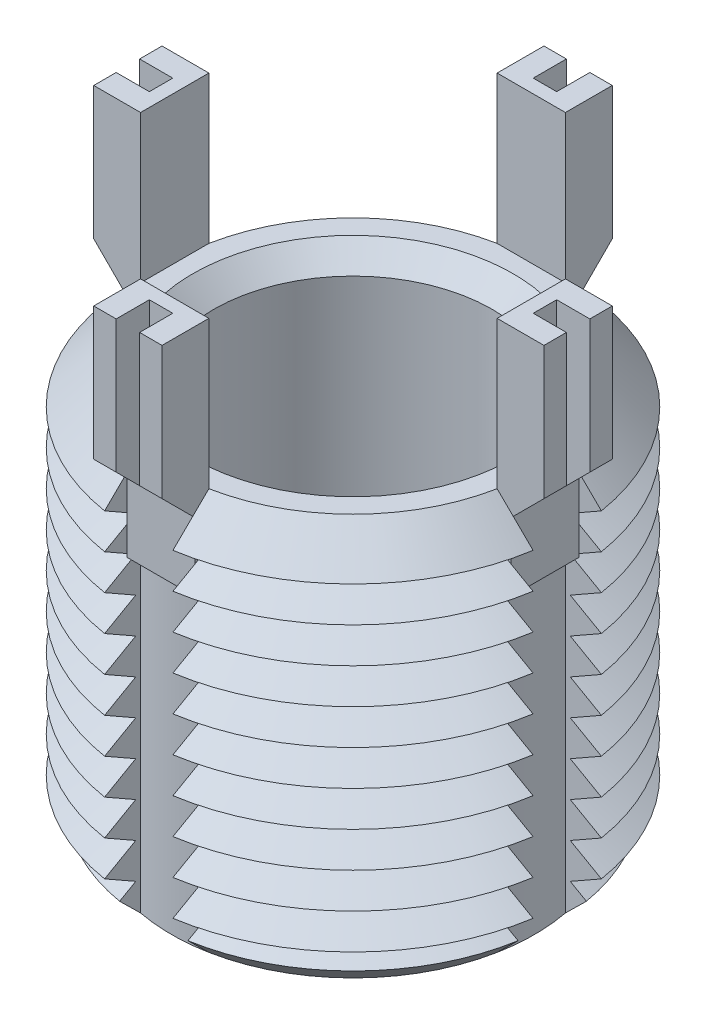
from build123d import *

# Parameters (mm, degrees)
SKETCH1_R               = 11.1125
BOSS_EXTRUDE1_DEPTH     = 20.574
CHAMFER1_SIZE           = 1.814
LPATTERN1_COUNT         = 10
LPATTERN1_PITCH         = 1.814
CUT_EXTRUDE1_REACH      = 27.889
CIRPATTERN1_COUNT       = 4
BOSS_EXTRUDE3_DEPTH     = 1.75
CIRPATTERN2_COUNT       = 4
CUT_EXTRUDE3_DEPTH      = 33.517673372
CUT_EXTRUDE3_DEPTH_BACK = 33.517673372
SKETCH6_W               = 1.7
SKETCH6_H               = 1.2
SKETCH6_W_2             = 1.2
SKETCH6_H_2             = 1.7
SKETCH7_R               = 7.144
CUT_EXTRUDE4_DEPTH      = 20.574
CHAMFER2_SIZE           = 1.0585


with BuildPart() as part:
    # Sketch1 → Boss-Extrude1 (new body)
    with BuildSketch(Plane(origin=(0, 0, 0), x_dir=(1, 0, 0), z_dir=(0, 1, 0))):
        with Locations(Location((0, 0, 0), (0, 0, 270))):
            Circle(SKETCH1_R)
    extrude(amount=-BOSS_EXTRUDE1_DEPTH)

    # Chamfer1
    chamfer1_edges = [part.edges().sort_by_distance(p)[0] for p in [
        (0, 0, -11.1125),
        (0, -20.574, -11.1125),
    ]]
    chamfer(chamfer1_edges, length=CHAMFER1_SIZE)

    # Sketch3 → Cut-Revolve1 (revolve, cut)
    with BuildSketch(Plane(origin=(0, 0, 0), x_dir=(0, 0, -1), z_dir=(1, 0, 0))):
        Polygon((-11.1125, -1.814), (-9.541529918, -2.721), (-11.1125, -3.628), align=None)
    cut_revolve1 = revolve(axis=Axis((0, 0.885892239, 0), (0, -1, 0)), mode=Mode.SUBTRACT)

    # LPattern1: Cut-Revolve1 ×10
    with Locations(*[(0, -i * LPATTERN1_PITCH, 0) for i in range(1, LPATTERN1_COUNT)]):
        add(cut_revolve1, mode=Mode.SUBTRACT)

    # Cut-Extrude1: up to this cone (the profile starts inside it)
    cut_extrude1_end = Plane(origin=(0, 0, 0), z_dir=(0, 1, 0)).offset(-29.872499) * Cone(1e-06, 88.134, 88.133999, align=(Align.CENTER, Align.CENTER, Align.MIN), mode=Mode.PRIVATE)
    # Sketch4 → Cut-Extrude1 (cut, up to the surface)
    with BuildSketch(Plane(origin=(0, 0, 0), x_dir=(1, 0, 0), z_dir=(0, 1, 0)), mode=Mode.PRIVATE) as cut_extrude1_sk1:
        with BuildLine():
            Line((-9.132338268, 1.75), (-10.973839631, 1.75))
            ThreePointArc((-10.973839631, 1.75), (-11.1125, 0), (-10.973839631, -1.75))
            Line((-10.973839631, -1.75), (-9.132338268, -1.75))
            ThreePointArc((-9.132338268, -1.75), (-9.2985, 0), (-9.132338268, 1.75))
        make_face()
    cut_extrude1_tool1 = extrude(cut_extrude1_sk1.sketch, amount=-CUT_EXTRUDE1_REACH, mode=Mode.PRIVATE) & cut_extrude1_end
    cut_extrude1 = cut_extrude1_tool1.solids().sort_by_distance((-10.154651, 0, 0))[0]
    add(cut_extrude1, mode=Mode.SUBTRACT)

    # CirPattern1: Cut-Extrude1 ×4 about axis
    cirpattern1_axis = Axis((0, 0, 0), (0, 1, 0))
    for i in range(1, CIRPATTERN1_COUNT):
        add(cut_extrude1.rotate(cirpattern1_axis, i * 360 / CIRPATTERN1_COUNT), mode=Mode.SUBTRACT)

    # Sketch5 → Boss-Extrude3 (add, symmetric)
    with BuildSketch(Plane(origin=(0, 0, 0), x_dir=(0, 0, -1), z_dir=(1, 0, 0))):
        Polygon((-9.132338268, 7.558), (-9.132338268, -4.442), (-9.832338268, -4.442), (-9.832338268, -0.942), (-11.532338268, 0.758), (-11.532338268, 7.558), align=None)
    boss_extrude3 = extrude(amount=BOSS_EXTRUDE3_DEPTH, both=True)

    # CirPattern2: Boss-Extrude3 ×4 about axis
    cirpattern2_axis = Axis((0, 0, 0), (0, 1, 0))
    for i in range(1, CIRPATTERN2_COUNT):
        add(boss_extrude3.rotate(cirpattern2_axis, i * 360 / CIRPATTERN2_COUNT))

    # Sketch6 → Cut-Extrude3 (cut, two sides: drawn at the far end of the back side and taken through both)
    with BuildSketch(Plane(origin=(0, 7.558, 0), x_dir=(1, 0, 0), z_dir=(0, 1, 0)).offset(-CUT_EXTRUDE3_DEPTH_BACK)):
        with Locations((-10.682338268, 0)):
            Rectangle(SKETCH6_W, SKETCH6_H)
        with Locations((0, 10.682338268)):
            Rectangle(SKETCH6_W_2, SKETCH6_H_2)
        with Locations((10.682338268, 0)):
            Rectangle(SKETCH6_W, SKETCH6_H)
        with Locations((0, -10.682338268)):
            Rectangle(SKETCH6_W_2, SKETCH6_H_2)
    extrude(amount=CUT_EXTRUDE3_DEPTH + CUT_EXTRUDE3_DEPTH_BACK, mode=Mode.SUBTRACT)

    # Sketch7 → Cut-Extrude4 (cut)
    with BuildSketch(Plane(origin=(0, 0, 0), x_dir=(1, 0, 0), z_dir=(0, 1, 0))):
        with Locations(Location((0, 0, 0), (0, 0, 270))):
            Circle(SKETCH7_R)
    extrude(amount=-CUT_EXTRUDE4_DEPTH, mode=Mode.SUBTRACT)

    # Chamfer2
    chamfer2_edges = [part.edges().sort_by_distance(p)[0] for p in [
        (0, 0, -7.144),
        (0, -20.574, -7.144),
    ]]
    chamfer(chamfer2_edges, length=CHAMFER2_SIZE)


solid = part.part
